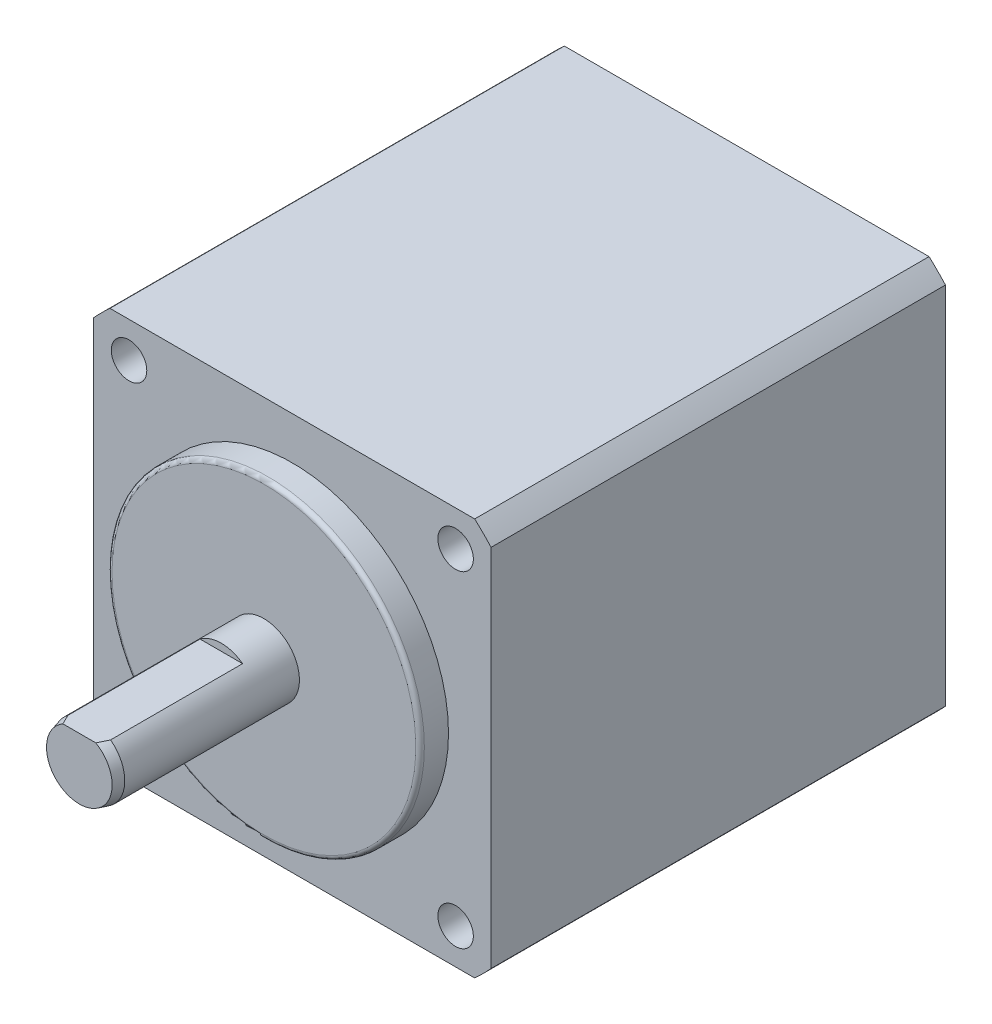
from build123d import *

# Parameters (mm, degrees)
SKETCH1_R      = 2.5
EXTRUDE1_DEPTH = 15
SKETCH2_R      = 11
EXTRUDE2_DEPTH = 2
EXTRUDE3_DEPTH = 32
SKETCH4_W      = 15.2
SKETCH4_H      = 9.5
EXTRUDE4_DEPTH = 5
SKETCH5_W      = 5.160305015
SKETCH5_H      = 2.199474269
EXTRUDE5_DEPTH = 10
CHAMFER1_SIZE  = 0.7
CHAMFER1_SIZE2 = 0.187564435
SKETCH6_R      = 1.25
EXTRUDE6_DEPTH = 4.5
FILLET2_R      = 0.3


with BuildPart() as part:
    # Sketch1 → Extrude1 (new body)
    with BuildSketch(Plane.XY):
        Circle(SKETCH1_R)
    extrude(amount=EXTRUDE1_DEPTH)

    # Sketch2 → Extrude2 (add)
    with BuildSketch(Plane(origin=(0, 0, 0), x_dir=(-1, 0, 0), z_dir=(0, 0, -1))):
        Circle(SKETCH2_R)
    extrude(amount=-EXTRUDE2_DEPTH)

    # Sketch5 → Extrude5 (cut)
    with BuildSketch(Plane.XY.offset(15)):
        with Locations((0.042297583, 3.099737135)):
            Rectangle(SKETCH5_W, SKETCH5_H)
    extrude(amount=-EXTRUDE5_DEPTH, mode=Mode.SUBTRACT)

    # Chamfer1
    chamfer1_edges = [part.edges().sort_by_distance(p)[0] for p in [
        (-1.118033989, -2.236067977, 15),
    ]]
    chamfer1_side = [part.faces().sort_by_distance(p)[0] for p in [
        (-2.5, 0, 8.5),
    ]]
    chamfer(chamfer1_edges, length=CHAMFER1_SIZE, length2=CHAMFER1_SIZE2, reference=chamfer1_side[0])

    # Fillet2
    fillet2_edges = [part.edges().sort_by_distance(p)[0] for p in [
        (11, 0, 2),
    ]]
    fillet(fillet2_edges, radius=FILLET2_R)


with BuildPart() as body_2:
    # Sketch3 → Extrude3 (new body)
    with BuildSketch(Plane(origin=(0, 0, 0), x_dir=(-1, 0, 0), z_dir=(0, 0, -1))):
        with BuildLine():
            Line((-12.845232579, -14), (12.845232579, -14))
            ThreePointArc((12.845232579, -14), (13.435028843, -13.435028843), (14, -12.845232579))
            Line((14, -12.845232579), (14, 12.845232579))
            ThreePointArc((14, 12.845232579), (13.435028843, 13.435028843), (12.845232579, 14))
            Line((12.845232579, 14), (-12.845232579, 14))
            ThreePointArc((-12.845232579, 14), (-13.435028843, 13.435028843), (-14, 12.845232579))
            Line((-14, 12.845232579), (-14, -12.845232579))
            ThreePointArc((-14, -12.845232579), (-13.435028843, -13.435028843), (-12.845232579, -14))
        make_face()
    extrude(amount=EXTRUDE3_DEPTH)

    # Sketch4 → Extrude4 (add)
    with BuildSketch(Plane.XZ.offset(14)):
        with Locations((0, -27.25)):
            Rectangle(SKETCH4_W, SKETCH4_H)
    extrude(amount=EXTRUDE4_DEPTH)

    # Sketch6 → Extrude6 (cut)
    with BuildSketch(Plane.XY):
        with Locations((-11.5, 11.5)):
            Circle(SKETCH6_R)
        with Locations((11.5, 11.5)):
            Circle(SKETCH6_R)
        with Locations((-11.5, -11.5)):
            Circle(SKETCH6_R)
        with Locations((11.5, -11.5)):
            Circle(SKETCH6_R)
    extrude(amount=-EXTRUDE6_DEPTH, mode=Mode.SUBTRACT)


solid = Compound([part.part, body_2.part])
